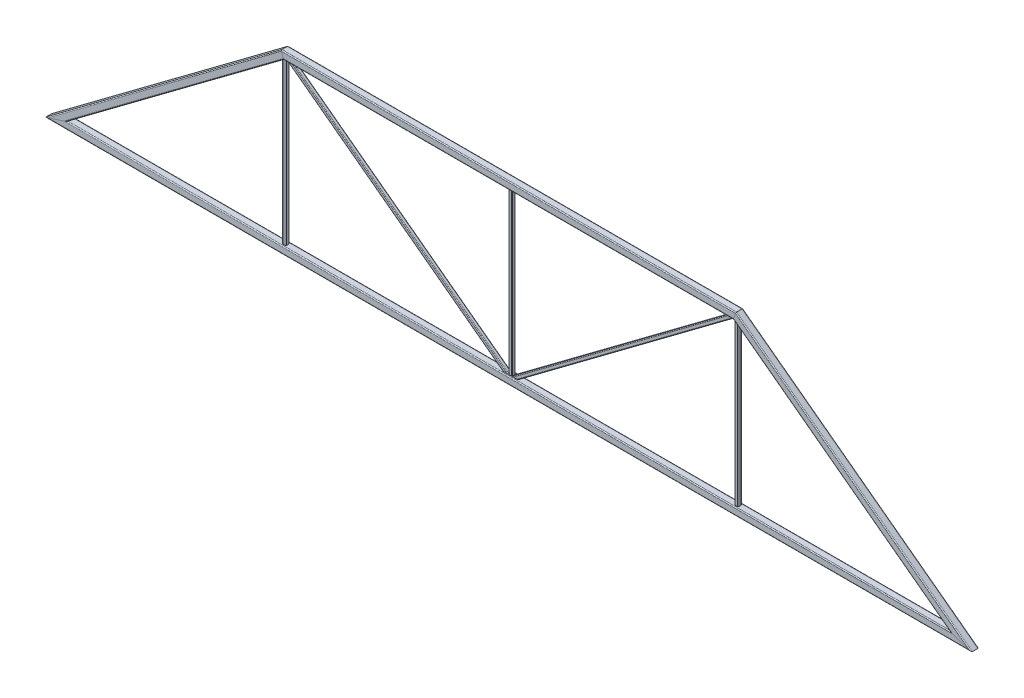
from build123d import *

# Parameters (mm, degrees)
MIEMBRO_ESTRUCTURAL1_DEPTH        = 10171.192783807
MIEMBRO_ESTRUCTURAL1_DEPTH_BACK   = 171.192783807
MIEMBRO_ESTRUCTURAL1_2_DEPTH      = 3311.978401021
MIEMBRO_ESTRUCTURAL1_3_DEPTH      = 5039.604414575
MIEMBRO_ESTRUCTURAL1_4_DEPTH      = 3311.978401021
MIEMBRO_ESTRUCTURAL2_DEPTH        = 1925.745283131
MIEMBRO_ESTRUCTURAL2_2_DEPTH      = 3200.568064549
MIEMBRO_ESTRUCTURAL2_3_DEPTH      = 3200.568064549
MIEMBRO_ESTRUCTURAL2_4_DEPTH      = 1868.298007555
MIEMBRO_ESTRUCTURAL2_4_DEPTH_BACK = 57.447275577
MIEMBRO_ESTRUCTURAL3_DEPTH        = 1868.298007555


with BuildPart() as part:
    # Sketch1 → Miembro estructural1 (new, two sides: drawn at the far end of the back side and taken through both)
    with BuildSketch(Plane.YZ.offset(-5000).offset(-MIEMBRO_ESTRUCTURAL1_DEPTH_BACK)):
        with BuildLine():
            Line((-30, -40), (30, -40))
            ThreePointArc((30, -40), (37.071067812, -37.071067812), (40, -30))
            Line((40, -30), (40, 30))
            ThreePointArc((40, 30), (37.071067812, 37.071067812), (30, 40))
            Line((30, 40), (-30, 40))
            ThreePointArc((-30, 40), (-37.071067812, 37.071067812), (-40, 30))
            Line((-40, 30), (-40, -30))
            ThreePointArc((-40, -30), (-37.071067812, -37.071067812), (-30, -40))
        make_face()
        with BuildLine():
            Line((-30, -35), (30, -35))
            ThreePointArc((30, -35), (33.535533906, -33.535533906), (35, -30))
            Line((35, -30), (35, 30))
            ThreePointArc((35, 30), (33.535533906, 33.535533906), (30, 35))
            Line((30, 35), (-30, 35))
            ThreePointArc((-30, 35), (-33.535533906, 33.535533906), (-35, 30))
            Line((-35, 30), (-35, -30))
            ThreePointArc((-35, -30), (-33.535533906, -33.535533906), (-30, -35))
        make_face(mode=Mode.SUBTRACT)
    extrude(amount=MIEMBRO_ESTRUCTURAL1_DEPTH + MIEMBRO_ESTRUCTURAL1_DEPTH_BACK)

    # Miembro estructural1 mitre 1
    split(bisect_by=Plane(origin=(-5000, 0, 0), x_dir=(0.948954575, 0.315412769, 0), z_dir=(0.315412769, -0.948954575, 0)), keep=Keep.TOP)

    # Miembro estructural1 mitre 2
    split(bisect_by=Plane(origin=(5000, 0, 0), x_dir=(0.948954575, -0.315412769, 0), z_dir=(-0.315412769, -0.948954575, 0)), keep=Keep.TOP)


with BuildPart() as body_2:
    # Sketch1 on segment 2 (on carried to segment 2) → Miembro estructural1 2 (new body)
    with BuildSketch(Plane(origin=(5137.130482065, -102.480242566, 0), x_dir=(-0.59862478, -0.80102957, 0), z_dir=(-0.80102957, 0.59862478, 0))):
        with BuildLine():
            Line((-30, -40), (30, -40))
            ThreePointArc((30, -40), (37.071067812, -37.071067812), (40, -30))
            Line((40, -30), (40, 30))
            ThreePointArc((40, 30), (37.071067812, 37.071067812), (30, 40))
            Line((30, 40), (-30, 40))
            ThreePointArc((-30, 40), (-37.071067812, 37.071067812), (-40, 30))
            Line((-40, 30), (-40, -30))
            ThreePointArc((-40, -30), (-37.071067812, -37.071067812), (-30, -40))
        make_face()
        with BuildLine():
            Line((-30, -35), (30, -35))
            ThreePointArc((30, -35), (33.535533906, -33.535533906), (35, -30))
            Line((35, -30), (35, 30))
            ThreePointArc((35, 30), (33.535533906, 33.535533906), (30, 35))
            Line((30, 35), (-30, 35))
            ThreePointArc((-30, 35), (-33.535533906, 33.535533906), (-35, 30))
            Line((-35, 30), (-35, -30))
            ThreePointArc((-35, -30), (-33.535533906, -33.535533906), (-30, -35))
        make_face(mode=Mode.SUBTRACT)
    extrude(amount=MIEMBRO_ESTRUCTURAL1_2_DEPTH)

    # Miembro estructural1 2 mitre 1
    split(bisect_by=Plane(origin=(2500, 1868.298007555, 0), x_dir=(0.315412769, 0.948954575, 0), z_dir=(0.948954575, -0.315412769, 0)), keep=Keep.TOP)

    # Miembro estructural1 2 mitre 2
    split(bisect_by=Plane(origin=(5000, 0, 0), x_dir=(-0.948954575, 0.315412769, 0), z_dir=(0.315412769, 0.948954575, 0)), keep=Keep.TOP)


with BuildPart() as body_3:
    # Sketch1 on segment 3 (on carried to segment 3) → Miembro estructural1 3 (new body)
    with BuildSketch(Plane(origin=(2519.802207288, 1868.298007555, 0), x_dir=(0, -1, 0), z_dir=(-1, 0, 0))):
        with BuildLine():
            Line((-30, -40), (30, -40))
            ThreePointArc((30, -40), (37.071067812, -37.071067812), (40, -30))
            Line((40, -30), (40, 30))
            ThreePointArc((40, 30), (37.071067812, 37.071067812), (30, 40))
            Line((30, 40), (-30, 40))
            ThreePointArc((-30, 40), (-37.071067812, 37.071067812), (-40, 30))
            Line((-40, 30), (-40, -30))
            ThreePointArc((-40, -30), (-37.071067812, -37.071067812), (-30, -40))
        make_face()
        with BuildLine():
            Line((-30, -35), (30, -35))
            ThreePointArc((30, -35), (33.535533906, -33.535533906), (35, -30))
            Line((35, -30), (35, 30))
            ThreePointArc((35, 30), (33.535533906, 33.535533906), (30, 35))
            Line((30, 35), (-30, 35))
            ThreePointArc((-30, 35), (-33.535533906, 33.535533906), (-35, 30))
            Line((-35, 30), (-35, -30))
            ThreePointArc((-35, -30), (-33.535533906, -33.535533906), (-30, -35))
        make_face(mode=Mode.SUBTRACT)
    extrude(amount=MIEMBRO_ESTRUCTURAL1_3_DEPTH)

    # Miembro estructural1 3 mitre 1
    split(bisect_by=Plane(origin=(-2500, 1868.298007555, 0), x_dir=(-0.315412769, 0.948954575, 0), z_dir=(0.948954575, 0.315412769, 0)), keep=Keep.TOP)

    # Miembro estructural1 3 mitre 2
    split(bisect_by=Plane(origin=(2500, 1868.298007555, 0), x_dir=(-0.315412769, -0.948954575, 0), z_dir=(-0.948954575, 0.315412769, 0)), keep=Keep.TOP)


with BuildPart() as body_4:
    # Sketch1 on segment 4 (on carried to segment 4) → Miembro estructural1 4 (new body)
    with BuildSketch(Plane(origin=(-2484.137846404, 1880.152099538, 0), x_dir=(0.59862478, -0.80102957, 0), z_dir=(-0.80102957, -0.59862478, 0))):
        with BuildLine():
            Line((-30, -40), (30, -40))
            ThreePointArc((30, -40), (37.071067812, -37.071067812), (40, -30))
            Line((40, -30), (40, 30))
            ThreePointArc((40, 30), (37.071067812, 37.071067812), (30, 40))
            Line((30, 40), (-30, 40))
            ThreePointArc((-30, 40), (-37.071067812, 37.071067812), (-40, 30))
            Line((-40, 30), (-40, -30))
            ThreePointArc((-40, -30), (-37.071067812, -37.071067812), (-30, -40))
        make_face()
        with BuildLine():
            Line((-30, -35), (30, -35))
            ThreePointArc((30, -35), (33.535533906, -33.535533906), (35, -30))
            Line((35, -30), (35, 30))
            ThreePointArc((35, 30), (33.535533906, 33.535533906), (30, 35))
            Line((30, 35), (-30, 35))
            ThreePointArc((-30, 35), (-33.535533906, 33.535533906), (-35, 30))
            Line((-35, 30), (-35, -30))
            ThreePointArc((-35, -30), (-33.535533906, -33.535533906), (-30, -35))
        make_face(mode=Mode.SUBTRACT)
    extrude(amount=MIEMBRO_ESTRUCTURAL1_4_DEPTH)

    # Miembro estructural1 4 mitre 1
    split(bisect_by=Plane(origin=(-5000, 0, 0), x_dir=(-0.948954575, -0.315412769, 0), z_dir=(-0.315412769, 0.948954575, 0)), keep=Keep.TOP)

    # Miembro estructural1 4 mitre 2
    split(bisect_by=Plane(origin=(-2500, 1868.298007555, 0), x_dir=(0.315412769, -0.948954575, 0), z_dir=(-0.948954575, -0.315412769, 0)), keep=Keep.TOP)


with BuildPart() as body_5:
    # Sketch11 on segment 1 (on carried to segment 1) → Miembro estructural2 (new body)
    with BuildSketch(Plane(origin=(2500, 0, 0), x_dir=(-1, 0, 0), z_dir=(0, 1, 0))):
        with BuildLine():
            Line((-12, -20), (12, -20))
            ThreePointArc((12, -20), (17.656854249, -17.656854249), (20, -12))
            Line((20, -12), (20, 12))
            ThreePointArc((20, 12), (17.656854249, 17.656854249), (12, 20))
            Line((12, 20), (-12, 20))
            ThreePointArc((-12, 20), (-17.656854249, 17.656854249), (-20, 12))
            Line((-20, 12), (-20, -12))
            ThreePointArc((-20, -12), (-17.656854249, -17.656854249), (-12, -20))
        make_face()
        with BuildLine():
            Line((-12, -16), (12, -16))
            ThreePointArc((12, -16), (14.828427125, -14.828427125), (16, -12))
            Line((16, -12), (16, 12))
            ThreePointArc((16, 12), (14.828427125, 14.828427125), (12, 16))
            Line((12, 16), (-12, 16))
            ThreePointArc((-12, 16), (-14.828427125, 14.828427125), (-16, 12))
            Line((-16, 12), (-16, -12))
            ThreePointArc((-16, -12), (-14.828427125, -14.828427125), (-12, -16))
        make_face(mode=Mode.SUBTRACT)
    extrude(amount=MIEMBRO_ESTRUCTURAL2_DEPTH)

    # Miembro estructural2 mitre 1
    split(bisect_by=Plane(origin=(2500, 1868.298007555, 0), x_dir=(0.447981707, 0.894042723, 0), z_dir=(0.894042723, -0.447981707, 0)), keep=Keep.TOP)

    # Recortar_Extender5 43
    split(bisect_by=Plane(origin=(0, 40, 0), x_dir=(-1, 0, 0), z_dir=(0, 1, 0)), keep=Keep.TOP)

    # Recortar_Extender6 15
    split(bisect_by=Plane.XZ.offset(-1828.298007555), keep=Keep.TOP)

    # Recortar_Extender6 60
    split(bisect_by=Plane(origin=(3683.18018021, 934.14900396, 0), x_dir=(0.80102957, -0.59862478, 0), z_dir=(-0.59862478, -0.80102957, 0)), keep=Keep.TOP)


with BuildPart() as body_6:
    # Sketch11 on segment 2 (on carried to segment 2) → Miembro estructural2 2 (new body)
    with BuildSketch(Plane(origin=(2546.016966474, 1902.687370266, 0), x_dir=(0.59862478, -0.80102957, 0), z_dir=(-0.80102957, -0.59862478, 0))):
        with BuildLine():
            Line((-12, -20), (12, -20))
            ThreePointArc((12, -20), (17.656854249, -17.656854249), (20, -12))
            Line((20, -12), (20, 12))
            ThreePointArc((20, 12), (17.656854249, 17.656854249), (12, 20))
            Line((12, 20), (-12, 20))
            ThreePointArc((-12, 20), (-17.656854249, 17.656854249), (-20, 12))
            Line((-20, 12), (-20, -12))
            ThreePointArc((-20, -12), (-17.656854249, -17.656854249), (-12, -20))
        make_face()
        with BuildLine():
            Line((-12, -16), (12, -16))
            ThreePointArc((12, -16), (14.828427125, -14.828427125), (16, -12))
            Line((16, -12), (16, 12))
            ThreePointArc((16, 12), (14.828427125, 14.828427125), (12, 16))
            Line((12, 16), (-12, 16))
            ThreePointArc((-12, 16), (-14.828427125, 14.828427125), (-16, 12))
            Line((-16, 12), (-16, -12))
            ThreePointArc((-16, -12), (-14.828427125, -14.828427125), (-12, -16))
        make_face(mode=Mode.SUBTRACT)
    extrude(amount=MIEMBRO_ESTRUCTURAL2_2_DEPTH)

    # Miembro estructural2 2 mitre 1
    split(bisect_by=Plane.YZ, keep=Keep.TOP)

    # Miembro estructural2 2 mitre 2
    split(bisect_by=Plane(origin=(2500, 1868.298007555, 0), x_dir=(-0.447981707, -0.894042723, 0), z_dir=(-0.894042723, 0.447981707, 0)), keep=Keep.TOP)

    # Recortar_Extender4 15
    split(bisect_by=Plane(origin=(0, 40, 0), x_dir=(-1, 0, 0), z_dir=(0, 1, 0)), keep=Keep.TOP)

    # Recortar_Extender7 15
    split(bisect_by=Plane.XZ.offset(-1828.298007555), keep=Keep.TOP)


with BuildPart() as body_7:
    # Sketch11 on segment 3 (on carried to segment 3) → Miembro estructural2 3 (new body)
    with BuildSketch(Plane(origin=(17.732695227, -13.251983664, 0), x_dir=(-0.59862478, -0.80102957, 0), z_dir=(-0.80102957, 0.59862478, 0))):
        with BuildLine():
            Line((-12, -20), (12, -20))
            ThreePointArc((12, -20), (17.656854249, -17.656854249), (20, -12))
            Line((20, -12), (20, 12))
            ThreePointArc((20, 12), (17.656854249, 17.656854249), (12, 20))
            Line((12, 20), (-12, 20))
            ThreePointArc((-12, 20), (-17.656854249, 17.656854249), (-20, 12))
            Line((-20, 12), (-20, -12))
            ThreePointArc((-20, -12), (-17.656854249, -17.656854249), (-12, -20))
        make_face()
        with BuildLine():
            Line((-12, -16), (12, -16))
            ThreePointArc((12, -16), (14.828427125, -14.828427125), (16, -12))
            Line((16, -12), (16, 12))
            ThreePointArc((16, 12), (14.828427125, 14.828427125), (12, 16))
            Line((12, 16), (-12, 16))
            ThreePointArc((-12, 16), (-14.828427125, 14.828427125), (-16, 12))
            Line((-16, 12), (-16, -12))
            ThreePointArc((-16, -12), (-14.828427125, -14.828427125), (-12, -16))
        make_face(mode=Mode.SUBTRACT)
    extrude(amount=MIEMBRO_ESTRUCTURAL2_3_DEPTH)

    # Miembro estructural2 3 mitre 1
    split(bisect_by=Plane(origin=(0, 0, 0), x_dir=(0, -1, 0), z_dir=(-1, 0, 0)), keep=Keep.TOP)

    # Miembro estructural2 3 mitre 2
    split(bisect_by=Plane(origin=(-2500, 1868.298007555, 0), x_dir=(-0.447981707, 0.894042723, 0), z_dir=(0.894042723, 0.447981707, 0)), keep=Keep.TOP)

    # Recortar_Extender2 15
    split(bisect_by=Plane(origin=(-3683.180179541, 934.14900396, 0), x_dir=(0.80102957, 0.59862478, 0), z_dir=(0.59862478, -0.80102957, 0)), keep=Keep.TOP)

    # Recortar_Extender2 60
    split(bisect_by=Plane.XZ.offset(-1828.298007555), keep=Keep.TOP)

    # Recortar_Extender3 15
    split(bisect_by=Plane(origin=(0, 40, 0), x_dir=(-1, 0, 0), z_dir=(0, 1, 0)), keep=Keep.TOP)


with BuildPart() as body_8:
    # Sketch11 → Miembro estructural2 4 (new, two sides: drawn at the far end of the back side and taken through both)
    with BuildSketch(Plane(origin=(-2500, 1868.298007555, 0), x_dir=(1, 0, 0), z_dir=(0, -1, 0)).offset(-MIEMBRO_ESTRUCTURAL2_4_DEPTH_BACK)):
        with BuildLine():
            Line((-12, -20), (12, -20))
            ThreePointArc((12, -20), (17.656854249, -17.656854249), (20, -12))
            Line((20, -12), (20, 12))
            ThreePointArc((20, 12), (17.656854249, 17.656854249), (12, 20))
            Line((12, 20), (-12, 20))
            ThreePointArc((-12, 20), (-17.656854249, 17.656854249), (-20, 12))
            Line((-20, 12), (-20, -12))
            ThreePointArc((-20, -12), (-17.656854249, -17.656854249), (-12, -20))
        make_face()
        with BuildLine():
            Line((-12, -16), (12, -16))
            ThreePointArc((12, -16), (14.828427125, -14.828427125), (16, -12))
            Line((16, -12), (16, 12))
            ThreePointArc((16, 12), (14.828427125, 14.828427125), (12, 16))
            Line((12, 16), (-12, 16))
            ThreePointArc((-12, 16), (-14.828427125, 14.828427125), (-16, 12))
            Line((-16, 12), (-16, -12))
            ThreePointArc((-16, -12), (-14.828427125, -14.828427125), (-12, -16))
        make_face(mode=Mode.SUBTRACT)
    extrude(amount=MIEMBRO_ESTRUCTURAL2_4_DEPTH + MIEMBRO_ESTRUCTURAL2_4_DEPTH_BACK)

    # Miembro estructural2 4 mitre 1
    split(bisect_by=Plane(origin=(-2500, 1868.298007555, 0), x_dir=(0.447981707, -0.894042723, 0), z_dir=(-0.894042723, -0.447981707, 0)), keep=Keep.TOP)

    # Recortar_Extender1 15
    split(bisect_by=Plane(origin=(-3683.180179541, 934.14900396, 0), x_dir=(0.80102957, 0.59862478, 0), z_dir=(0.59862478, -0.80102957, 0)), keep=Keep.TOP)

    # Recortar_Extender1 86
    split(bisect_by=Plane.XZ.offset(-1828.298007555), keep=Keep.TOP)


with BuildPart() as body_9:
    # Sketch12 → Miembro estructural3 (new body)
    with BuildSketch(Plane(origin=(0, 0, 0), x_dir=(-1, 0, 0), z_dir=(0, 1, 0))):
        with BuildLine():
            Line((-12, -20), (12, -20))
            ThreePointArc((12, -20), (17.656854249, -17.656854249), (20, -12))
            Line((20, -12), (20, 12))
            ThreePointArc((20, 12), (17.656854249, 17.656854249), (12, 20))
            Line((12, 20), (-12, 20))
            ThreePointArc((-12, 20), (-17.656854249, 17.656854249), (-20, 12))
            Line((-20, 12), (-20, -12))
            ThreePointArc((-20, -12), (-17.656854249, -17.656854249), (-12, -20))
        make_face()
        with BuildLine():
            Line((-12, -16), (12, -16))
            ThreePointArc((12, -16), (14.828427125, -14.828427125), (16, -12))
            Line((16, -12), (16, 12))
            ThreePointArc((16, 12), (14.828427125, 14.828427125), (12, 16))
            Line((12, 16), (-12, 16))
            ThreePointArc((-12, 16), (-14.828427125, 14.828427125), (-16, 12))
            Line((-16, 12), (-16, -12))
            ThreePointArc((-16, -12), (-14.828427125, -14.828427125), (-12, -16))
        make_face(mode=Mode.SUBTRACT)
    extrude(amount=MIEMBRO_ESTRUCTURAL3_DEPTH)

    # Recortar_Extender8 15
    split(bisect_by=Plane(origin=(0, 40, 0), x_dir=(-1, 0, 0), z_dir=(0, 1, 0)), keep=Keep.TOP)

    # Recortar_Extender9 15
    split(bisect_by=Plane.XZ.offset(-1828.298007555), keep=Keep.TOP)


solid = Compound([part.part, body_2.part, body_3.part, body_4.part, body_5.part, body_6.part, body_7.part, body_8.part, body_9.part])
